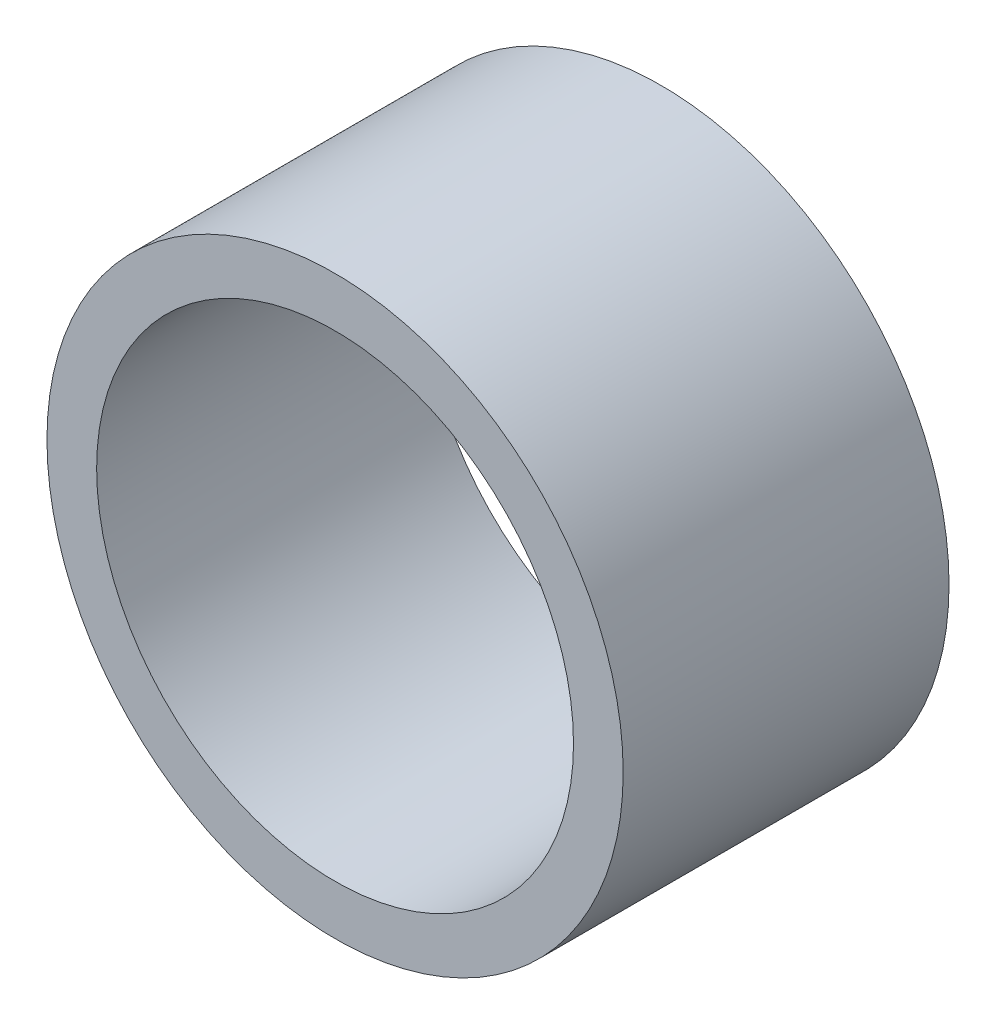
ISO-10303-21;
HEADER;
FILE_DESCRIPTION(('STEP AP214'),'2;1');
FILE_NAME('part.step','',(''),(''),'','','');
FILE_SCHEMA(('AUTOMOTIVE_DESIGN { 1 0 10303 214 1 1 1 1 }'));
ENDSEC;
DATA;
#1=APPLICATION_CONTEXT('core data for automotive mechanical design processes');
#2=APPLICATION_PROTOCOL_DEFINITION('international standard','automotive_design',2000,#1);
#3=PRODUCT_CONTEXT('',#1,'mechanical');
#4=PRODUCT('Part','Part','',(#3));
#5=PRODUCT_RELATED_PRODUCT_CATEGORY('part','',(#4));
#6=PRODUCT_DEFINITION_FORMATION('','',#4);
#7=PRODUCT_DEFINITION_CONTEXT('part definition',#1,'design');
#8=PRODUCT_DEFINITION('design','',#6,#7);
#9=PRODUCT_DEFINITION_SHAPE('','',#8);
#10=(LENGTH_UNIT() NAMED_UNIT(*) SI_UNIT(.MILLI.,.METRE.));
#11=(NAMED_UNIT(*) PLANE_ANGLE_UNIT() SI_UNIT($,.RADIAN.));
#12=(NAMED_UNIT(*) SI_UNIT($,.STERADIAN.) SOLID_ANGLE_UNIT());
#13=UNCERTAINTY_MEASURE_WITH_UNIT(LENGTH_MEASURE(1.E-05),#10,'distance_accuracy_value','');
#14=(GEOMETRIC_REPRESENTATION_CONTEXT(3) GLOBAL_UNCERTAINTY_ASSIGNED_CONTEXT((#13)) GLOBAL_UNIT_ASSIGNED_CONTEXT((#10,
#11,#12)) REPRESENTATION_CONTEXT('',''));
#15=CARTESIAN_POINT('',(0.,0.,0.));
#16=DIRECTION('',(0.,0.,1.));
#17=DIRECTION('',(1.,0.,0.));
#18=AXIS2_PLACEMENT_3D('',#15,#16,#17);
#19=CARTESIAN_POINT('',(0.,0.,0.));
#20=DIRECTION('',(0.,0.,1.));
#21=DIRECTION('',(1.,0.,0.));
#22=AXIS2_PLACEMENT_3D('',#19,#20,#21);
#23=PLANE('',#22);
#24=CARTESIAN_POINT('',(0.,0.,0.));
#25=DIRECTION('',(0.,0.,1.));
#26=DIRECTION('',(1.,0.,0.));
#27=AXIS2_PLACEMENT_3D('',#24,#25,#26);
#28=CIRCLE('',#27,14.5);
#29=CARTESIAN_POINT('',(14.5,0.,0.));
#30=VERTEX_POINT('',#29);
#31=EDGE_CURVE('E29',#30,#30,#28,.T.);
#32=ORIENTED_EDGE('',*,*,#31,.F.);
#33=EDGE_LOOP('',(#32));
#34=FACE_BOUND('',#33,.T.);
#35=CARTESIAN_POINT('',(0.,0.,0.));
#36=DIRECTION('',(0.,0.,1.));
#37=DIRECTION('',(1.,0.,0.));
#38=AXIS2_PLACEMENT_3D('',#35,#36,#37);
#39=CIRCLE('',#38,12.);
#40=CARTESIAN_POINT('',(12.,0.,0.));
#41=VERTEX_POINT('',#40);
#42=EDGE_CURVE('E38',#41,#41,#39,.T.);
#43=ORIENTED_EDGE('',*,*,#42,.T.);
#44=EDGE_LOOP('',(#43));
#45=FACE_BOUND('',#44,.T.);
#46=ADVANCED_FACE('F22',(#34,#45),#23,.F.);
#47=CARTESIAN_POINT('',(0.,0.,57.4121933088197));
#48=DIRECTION('',(0.,0.,-1.));
#49=DIRECTION('',(-1.,0.,0.));
#50=AXIS2_PLACEMENT_3D('',#47,#48,#49);
#51=CYLINDRICAL_SURFACE('',#50,14.5);
#52=CARTESIAN_POINT('',(0.,0.,16.4));
#53=DIRECTION('',(0.,0.,-1.));
#54=DIRECTION('',(-1.,0.,0.));
#55=AXIS2_PLACEMENT_3D('',#52,#53,#54);
#56=CIRCLE('',#55,14.5);
#57=CARTESIAN_POINT('',(-14.5,0.,16.4));
#58=VERTEX_POINT('',#57);
#59=EDGE_CURVE('E33',#58,#58,#56,.T.);
#60=ORIENTED_EDGE('',*,*,#59,.T.);
#61=EDGE_LOOP('',(#60));
#62=FACE_BOUND('',#61,.T.);
#63=ORIENTED_EDGE('',*,*,#31,.T.);
#64=EDGE_LOOP('',(#63));
#65=FACE_BOUND('',#64,.T.);
#66=ADVANCED_FACE('F46',(#62,#65),#51,.T.);
#67=CARTESIAN_POINT('',(0.,0.,57.4121933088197));
#68=DIRECTION('',(0.,0.,-1.));
#69=DIRECTION('',(-1.,0.,0.));
#70=AXIS2_PLACEMENT_3D('',#67,#68,#69);
#71=CYLINDRICAL_SURFACE('',#70,12.);
#72=CARTESIAN_POINT('',(0.,0.,16.4));
#73=DIRECTION('',(0.,0.,-1.));
#74=DIRECTION('',(-1.,0.,0.));
#75=AXIS2_PLACEMENT_3D('',#72,#73,#74);
#76=CIRCLE('',#75,12.);
#77=CARTESIAN_POINT('',(-12.,0.,16.4));
#78=VERTEX_POINT('',#77);
#79=EDGE_CURVE('E10',#78,#78,#76,.T.);
#80=ORIENTED_EDGE('',*,*,#79,.F.);
#81=EDGE_LOOP('',(#80));
#82=FACE_BOUND('',#81,.T.);
#83=ORIENTED_EDGE('',*,*,#42,.F.);
#84=EDGE_LOOP('',(#83));
#85=FACE_BOUND('',#84,.T.);
#86=ADVANCED_FACE('F44',(#82,#85),#71,.F.);
#87=CARTESIAN_POINT('',(0.,0.,16.4));
#88=DIRECTION('',(0.,0.,-1.));
#89=DIRECTION('',(-0.96577535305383,0.259379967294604,0.));
#90=AXIS2_PLACEMENT_3D('',#87,#88,#89);
#91=PLANE('',#90);
#92=ORIENTED_EDGE('',*,*,#79,.T.);
#93=EDGE_LOOP('',(#92));
#94=FACE_BOUND('',#93,.T.);
#95=ORIENTED_EDGE('',*,*,#59,.F.);
#96=EDGE_LOOP('',(#95));
#97=FACE_BOUND('',#96,.T.);
#98=ADVANCED_FACE('F24',(#94,#97),#91,.F.);
#99=CLOSED_SHELL('',(#46,#66,#86,#98));
#100=MANIFOLD_SOLID_BREP('B2',#99);
#101=ADVANCED_BREP_SHAPE_REPRESENTATION('',(#18,#100),#14);
#102=SHAPE_DEFINITION_REPRESENTATION(#9,#101);
ENDSEC;
END-ISO-10303-21;
